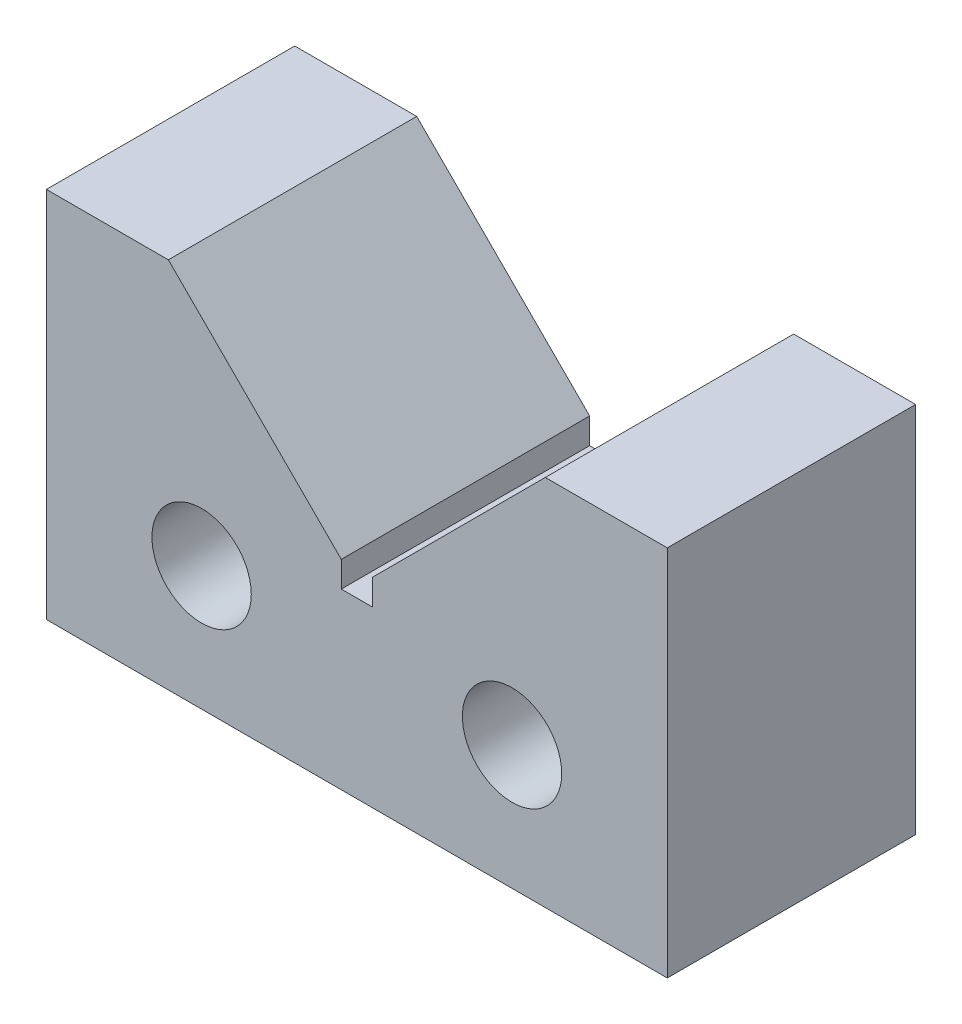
ISO-10303-21;
HEADER;
FILE_DESCRIPTION(('STEP AP214'),'2;1');
FILE_NAME('part.step','',(''),(''),'','','');
FILE_SCHEMA(('AUTOMOTIVE_DESIGN { 1 0 10303 214 1 1 1 1 }'));
ENDSEC;
DATA;
#1=APPLICATION_CONTEXT('core data for automotive mechanical design processes');
#2=APPLICATION_PROTOCOL_DEFINITION('international standard','automotive_design',2000,#1);
#3=PRODUCT_CONTEXT('',#1,'mechanical');
#4=PRODUCT('Part','Part','',(#3));
#5=PRODUCT_RELATED_PRODUCT_CATEGORY('part','',(#4));
#6=PRODUCT_DEFINITION_FORMATION('','',#4);
#7=PRODUCT_DEFINITION_CONTEXT('part definition',#1,'design');
#8=PRODUCT_DEFINITION('design','',#6,#7);
#9=PRODUCT_DEFINITION_SHAPE('','',#8);
#10=(LENGTH_UNIT() NAMED_UNIT(*) SI_UNIT(.MILLI.,.METRE.));
#11=(NAMED_UNIT(*) PLANE_ANGLE_UNIT() SI_UNIT($,.RADIAN.));
#12=(NAMED_UNIT(*) SI_UNIT($,.STERADIAN.) SOLID_ANGLE_UNIT());
#13=UNCERTAINTY_MEASURE_WITH_UNIT(LENGTH_MEASURE(1.E-05),#10,'distance_accuracy_value','');
#14=(GEOMETRIC_REPRESENTATION_CONTEXT(3) GLOBAL_UNCERTAINTY_ASSIGNED_CONTEXT((#13)) GLOBAL_UNIT_ASSIGNED_CONTEXT((#10,
#11,#12)) REPRESENTATION_CONTEXT('',''));
#15=CARTESIAN_POINT('',(0.,0.,0.));
#16=DIRECTION('',(0.,0.,1.));
#17=DIRECTION('',(1.,0.,0.));
#18=AXIS2_PLACEMENT_3D('',#15,#16,#17);
#19=CARTESIAN_POINT('',(-50.,60.,40.));
#20=DIRECTION('',(0.,-1.,0.));
#21=DIRECTION('',(0.,0.,-1.));
#22=AXIS2_PLACEMENT_3D('',#19,#20,#21);
#23=PLANE('',#22);
#24=DIRECTION('',(0.,0.,1.));
#25=VECTOR('',#24,1.);
#26=CARTESIAN_POINT('',(-30.3553390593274,60.,40.));
#27=LINE('',#26,#25);
#28=CARTESIAN_POINT('',(-30.3553390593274,60.,0.));
#29=VERTEX_POINT('',#28);
#30=CARTESIAN_POINT('',(-30.3553390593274,60.,40.));
#31=VERTEX_POINT('',#30);
#32=EDGE_CURVE('E151',#29,#31,#27,.T.);
#33=ORIENTED_EDGE('',*,*,#32,.F.);
#34=DIRECTION('',(-1.,0.,0.));
#35=VECTOR('',#34,1.);
#36=CARTESIAN_POINT('',(-50.,60.,0.));
#37=LINE('',#36,#35);
#38=CARTESIAN_POINT('',(-50.,60.,0.));
#39=VERTEX_POINT('',#38);
#40=EDGE_CURVE('E175',#29,#39,#37,.T.);
#41=ORIENTED_EDGE('',*,*,#40,.T.);
#42=DIRECTION('',(0.,0.,-1.));
#43=VECTOR('',#42,1.);
#44=CARTESIAN_POINT('',(-50.,60.,40.));
#45=LINE('',#44,#43);
#46=CARTESIAN_POINT('',(-50.,60.,40.));
#47=VERTEX_POINT('',#46);
#48=EDGE_CURVE('E168',#47,#39,#45,.T.);
#49=ORIENTED_EDGE('',*,*,#48,.F.);
#50=DIRECTION('',(-1.,0.,0.));
#51=VECTOR('',#50,1.);
#52=CARTESIAN_POINT('',(-50.,60.,40.));
#53=LINE('',#52,#51);
#54=EDGE_CURVE('E164',#31,#47,#53,.T.);
#55=ORIENTED_EDGE('',*,*,#54,.F.);
#56=EDGE_LOOP('',(#33,#41,#49,#55));
#57=FACE_BOUND('',#56,.T.);
#58=ADVANCED_FACE('F30',(#57),#23,.F.);
#59=DIRECTION('',(0.,0.,-1.));
#60=VECTOR('',#59,1.);
#61=CARTESIAN_POINT('',(30.3553390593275,60.,40.));
#62=LINE('',#61,#60);
#63=CARTESIAN_POINT('',(30.3553390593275,60.,40.));
#64=VERTEX_POINT('',#63);
#65=CARTESIAN_POINT('',(30.3553390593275,60.,0.));
#66=VERTEX_POINT('',#65);
#67=EDGE_CURVE('E142',#64,#66,#62,.T.);
#68=ORIENTED_EDGE('',*,*,#67,.F.);
#69=CARTESIAN_POINT('',(50.,60.,40.));
#70=VERTEX_POINT('',#69);
#71=EDGE_CURVE('E165',#70,#64,#53,.T.);
#72=ORIENTED_EDGE('',*,*,#71,.F.);
#73=DIRECTION('',(0.,0.,-1.));
#74=VECTOR('',#73,1.);
#75=CARTESIAN_POINT('',(50.,60.,40.));
#76=LINE('',#75,#74);
#77=CARTESIAN_POINT('',(50.,60.,0.));
#78=VERTEX_POINT('',#77);
#79=EDGE_CURVE('E180',#70,#78,#76,.T.);
#80=ORIENTED_EDGE('',*,*,#79,.T.);
#81=EDGE_CURVE('E160',#78,#66,#37,.T.);
#82=ORIENTED_EDGE('',*,*,#81,.T.);
#83=EDGE_LOOP('',(#68,#72,#80,#82));
#84=FACE_BOUND('',#83,.T.);
#85=ADVANCED_FACE('F195',(#84),#23,.F.);
#86=CARTESIAN_POINT('',(-50.,0.,40.));
#87=DIRECTION('',(0.,0.,1.));
#88=DIRECTION('',(1.,0.,0.));
#89=AXIS2_PLACEMENT_3D('',#86,#87,#88);
#90=PLANE('',#89);
#91=CARTESIAN_POINT('',(25.,20.,40.));
#92=DIRECTION('',(0.,0.,1.));
#93=DIRECTION('',(1.,0.,0.));
#94=AXIS2_PLACEMENT_3D('',#91,#92,#93);
#95=CIRCLE('',#94,8.);
#96=CARTESIAN_POINT('',(33.,20.,40.));
#97=VERTEX_POINT('',#96);
#98=EDGE_CURVE('E337',#97,#97,#95,.T.);
#99=ORIENTED_EDGE('',*,*,#98,.F.);
#100=EDGE_LOOP('',(#99));
#101=FACE_BOUND('',#100,.T.);
#102=CARTESIAN_POINT('',(-25.,20.,40.));
#103=DIRECTION('',(0.,0.,1.));
#104=DIRECTION('',(1.,0.,0.));
#105=AXIS2_PLACEMENT_3D('',#102,#103,#104);
#106=CIRCLE('',#105,8.);
#107=CARTESIAN_POINT('',(-17.,20.,40.));
#108=VERTEX_POINT('',#107);
#109=EDGE_CURVE('E133',#108,#108,#106,.T.);
#110=ORIENTED_EDGE('',*,*,#109,.F.);
#111=EDGE_LOOP('',(#110));
#112=FACE_BOUND('',#111,.T.);
#113=DIRECTION('',(0.,-1.,0.));
#114=VECTOR('',#113,1.);
#115=CARTESIAN_POINT('',(-2.5,28.,40.));
#116=LINE('',#115,#114);
#117=CARTESIAN_POINT('',(-2.5,32.1446609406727,40.));
#118=VERTEX_POINT('',#117);
#119=CARTESIAN_POINT('',(-2.5,28.,40.));
#120=VERTEX_POINT('',#119);
#121=EDGE_CURVE('E112',#118,#120,#116,.T.);
#122=ORIENTED_EDGE('',*,*,#121,.F.);
#123=DIRECTION('',(-0.707106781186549,0.707106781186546,0.));
#124=VECTOR('',#123,1.);
#125=CARTESIAN_POINT('',(-10.1776695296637,39.8223304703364,40.));
#126=LINE('',#125,#124);
#127=EDGE_CURVE('E53',#118,#31,#126,.T.);
#128=ORIENTED_EDGE('',*,*,#127,.T.);
#129=ORIENTED_EDGE('',*,*,#54,.T.);
#130=DIRECTION('',(0.,-1.,0.));
#131=VECTOR('',#130,1.);
#132=CARTESIAN_POINT('',(-50.,60.,40.));
#133=LINE('',#132,#131);
#134=CARTESIAN_POINT('',(-50.,0.,40.));
#135=VERTEX_POINT('',#134);
#136=EDGE_CURVE('E156',#47,#135,#133,.T.);
#137=ORIENTED_EDGE('',*,*,#136,.T.);
#138=DIRECTION('',(1.,0.,0.));
#139=VECTOR('',#138,1.);
#140=CARTESIAN_POINT('',(-50.,0.,40.));
#141=LINE('',#140,#139);
#142=CARTESIAN_POINT('',(50.,0.,40.));
#143=VERTEX_POINT('',#142);
#144=EDGE_CURVE('E159',#135,#143,#141,.T.);
#145=ORIENTED_EDGE('',*,*,#144,.T.);
#146=DIRECTION('',(0.,1.,0.));
#147=VECTOR('',#146,1.);
#148=CARTESIAN_POINT('',(50.,60.,40.));
#149=LINE('',#148,#147);
#150=EDGE_CURVE('E162',#143,#70,#149,.T.);
#151=ORIENTED_EDGE('',*,*,#150,.T.);
#152=ORIENTED_EDGE('',*,*,#71,.T.);
#153=DIRECTION('',(-0.70710678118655,-0.707106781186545,0.));
#154=VECTOR('',#153,1.);
#155=CARTESIAN_POINT('',(-39.8223304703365,-10.1776695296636,40.));
#156=LINE('',#155,#154);
#157=CARTESIAN_POINT('',(2.5,32.1446609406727,40.));
#158=VERTEX_POINT('',#157);
#159=EDGE_CURVE('E148',#64,#158,#156,.T.);
#160=ORIENTED_EDGE('',*,*,#159,.T.);
#161=DIRECTION('',(0.,1.,0.));
#162=VECTOR('',#161,1.);
#163=CARTESIAN_POINT('',(2.5,32.1446609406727,40.));
#164=LINE('',#163,#162);
#165=CARTESIAN_POINT('',(2.5,28.,40.));
#166=VERTEX_POINT('',#165);
#167=EDGE_CURVE('E45',#166,#158,#164,.T.);
#168=ORIENTED_EDGE('',*,*,#167,.F.);
#169=DIRECTION('',(1.,0.,0.));
#170=VECTOR('',#169,1.);
#171=CARTESIAN_POINT('',(2.5,28.,40.));
#172=LINE('',#171,#170);
#173=EDGE_CURVE('E130',#120,#166,#172,.T.);
#174=ORIENTED_EDGE('',*,*,#173,.F.);
#175=EDGE_LOOP('',(#122,#128,#129,#137,#145,#151,#152,#160,#168,#174));
#176=FACE_BOUND('',#175,.T.);
#177=ADVANCED_FACE('F213',(#101,#112,#176),#90,.T.);
#178=CARTESIAN_POINT('',(-50.,0.,0.));
#179=DIRECTION('',(0.,0.,1.));
#180=DIRECTION('',(1.,0.,0.));
#181=AXIS2_PLACEMENT_3D('',#178,#179,#180);
#182=PLANE('',#181);
#183=CARTESIAN_POINT('',(25.,20.,0.));
#184=DIRECTION('',(0.,0.,1.));
#185=DIRECTION('',(1.,0.,0.));
#186=AXIS2_PLACEMENT_3D('',#183,#184,#185);
#187=CIRCLE('',#186,8.);
#188=CARTESIAN_POINT('',(33.,20.,0.));
#189=VERTEX_POINT('',#188);
#190=EDGE_CURVE('E335',#189,#189,#187,.T.);
#191=ORIENTED_EDGE('',*,*,#190,.T.);
#192=EDGE_LOOP('',(#191));
#193=FACE_BOUND('',#192,.T.);
#194=CARTESIAN_POINT('',(-25.,20.,0.));
#195=DIRECTION('',(0.,0.,1.));
#196=DIRECTION('',(1.,0.,0.));
#197=AXIS2_PLACEMENT_3D('',#194,#195,#196);
#198=CIRCLE('',#197,8.);
#199=CARTESIAN_POINT('',(-17.,20.,0.));
#200=VERTEX_POINT('',#199);
#201=EDGE_CURVE('E138',#200,#200,#198,.T.);
#202=ORIENTED_EDGE('',*,*,#201,.T.);
#203=EDGE_LOOP('',(#202));
#204=FACE_BOUND('',#203,.T.);
#205=DIRECTION('',(-0.707106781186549,0.707106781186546,0.));
#206=VECTOR('',#205,1.);
#207=CARTESIAN_POINT('',(-10.1776695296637,39.8223304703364,0.));
#208=LINE('',#207,#206);
#209=CARTESIAN_POINT('',(-2.5,32.1446609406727,0.));
#210=VERTEX_POINT('',#209);
#211=EDGE_CURVE('E11',#210,#29,#208,.T.);
#212=ORIENTED_EDGE('',*,*,#211,.F.);
#213=DIRECTION('',(0.,-1.,0.));
#214=VECTOR('',#213,1.);
#215=CARTESIAN_POINT('',(-2.5,28.,0.));
#216=LINE('',#215,#214);
#217=CARTESIAN_POINT('',(-2.5,28.,0.));
#218=VERTEX_POINT('',#217);
#219=EDGE_CURVE('E110',#210,#218,#216,.T.);
#220=ORIENTED_EDGE('',*,*,#219,.T.);
#221=DIRECTION('',(1.,0.,0.));
#222=VECTOR('',#221,1.);
#223=CARTESIAN_POINT('',(2.5,28.,0.));
#224=LINE('',#223,#222);
#225=CARTESIAN_POINT('',(2.5,28.,0.));
#226=VERTEX_POINT('',#225);
#227=EDGE_CURVE('E120',#218,#226,#224,.T.);
#228=ORIENTED_EDGE('',*,*,#227,.T.);
#229=DIRECTION('',(0.,1.,0.));
#230=VECTOR('',#229,1.);
#231=CARTESIAN_POINT('',(2.5,32.1446609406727,0.));
#232=LINE('',#231,#230);
#233=CARTESIAN_POINT('',(2.5,32.1446609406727,0.));
#234=VERTEX_POINT('',#233);
#235=EDGE_CURVE('E117',#226,#234,#232,.T.);
#236=ORIENTED_EDGE('',*,*,#235,.T.);
#237=DIRECTION('',(-0.70710678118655,-0.707106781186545,0.));
#238=VECTOR('',#237,1.);
#239=CARTESIAN_POINT('',(-39.8223304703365,-10.1776695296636,0.));
#240=LINE('',#239,#238);
#241=EDGE_CURVE('E38',#66,#234,#240,.T.);
#242=ORIENTED_EDGE('',*,*,#241,.F.);
#243=ORIENTED_EDGE('',*,*,#81,.F.);
#244=DIRECTION('',(0.,1.,0.));
#245=VECTOR('',#244,1.);
#246=CARTESIAN_POINT('',(50.,60.,0.));
#247=LINE('',#246,#245);
#248=CARTESIAN_POINT('',(50.,0.,0.));
#249=VERTEX_POINT('',#248);
#250=EDGE_CURVE('E173',#249,#78,#247,.T.);
#251=ORIENTED_EDGE('',*,*,#250,.F.);
#252=DIRECTION('',(1.,0.,0.));
#253=VECTOR('',#252,1.);
#254=CARTESIAN_POINT('',(-50.,0.,0.));
#255=LINE('',#254,#253);
#256=CARTESIAN_POINT('',(-50.,0.,0.));
#257=VERTEX_POINT('',#256);
#258=EDGE_CURVE('E171',#257,#249,#255,.T.);
#259=ORIENTED_EDGE('',*,*,#258,.F.);
#260=DIRECTION('',(0.,-1.,0.));
#261=VECTOR('',#260,1.);
#262=CARTESIAN_POINT('',(-50.,60.,0.));
#263=LINE('',#262,#261);
#264=EDGE_CURVE('E155',#39,#257,#263,.T.);
#265=ORIENTED_EDGE('',*,*,#264,.F.);
#266=ORIENTED_EDGE('',*,*,#40,.F.);
#267=EDGE_LOOP('',(#212,#220,#228,#236,#242,#243,#251,#259,#265,#266));
#268=FACE_BOUND('',#267,.T.);
#269=ADVANCED_FACE('F127',(#193,#204,#268),#182,.F.);
#270=CARTESIAN_POINT('',(-50.,60.,40.));
#271=DIRECTION('',(1.,0.,0.));
#272=DIRECTION('',(0.,1.,0.));
#273=AXIS2_PLACEMENT_3D('',#270,#271,#272);
#274=PLANE('',#273);
#275=ORIENTED_EDGE('',*,*,#264,.T.);
#276=DIRECTION('',(0.,0.,-1.));
#277=VECTOR('',#276,1.);
#278=CARTESIAN_POINT('',(-50.,0.,40.));
#279=LINE('',#278,#277);
#280=EDGE_CURVE('E186',#135,#257,#279,.T.);
#281=ORIENTED_EDGE('',*,*,#280,.F.);
#282=ORIENTED_EDGE('',*,*,#136,.F.);
#283=ORIENTED_EDGE('',*,*,#48,.T.);
#284=EDGE_LOOP('',(#275,#281,#282,#283));
#285=FACE_BOUND('',#284,.T.);
#286=ADVANCED_FACE('F32',(#285),#274,.F.);
#287=CARTESIAN_POINT('',(-50.,0.,40.));
#288=DIRECTION('',(0.,1.,0.));
#289=DIRECTION('',(0.,0.,1.));
#290=AXIS2_PLACEMENT_3D('',#287,#288,#289);
#291=PLANE('',#290);
#292=ORIENTED_EDGE('',*,*,#258,.T.);
#293=DIRECTION('',(0.,0.,-1.));
#294=VECTOR('',#293,1.);
#295=CARTESIAN_POINT('',(50.,0.,40.));
#296=LINE('',#295,#294);
#297=EDGE_CURVE('E183',#143,#249,#296,.T.);
#298=ORIENTED_EDGE('',*,*,#297,.F.);
#299=ORIENTED_EDGE('',*,*,#144,.F.);
#300=ORIENTED_EDGE('',*,*,#280,.T.);
#301=EDGE_LOOP('',(#292,#298,#299,#300));
#302=FACE_BOUND('',#301,.T.);
#303=ADVANCED_FACE('F205',(#302),#291,.F.);
#304=CARTESIAN_POINT('',(50.,60.,40.));
#305=DIRECTION('',(-1.,0.,0.));
#306=DIRECTION('',(0.,-1.,0.));
#307=AXIS2_PLACEMENT_3D('',#304,#305,#306);
#308=PLANE('',#307);
#309=ORIENTED_EDGE('',*,*,#250,.T.);
#310=ORIENTED_EDGE('',*,*,#79,.F.);
#311=ORIENTED_EDGE('',*,*,#150,.F.);
#312=ORIENTED_EDGE('',*,*,#297,.T.);
#313=EDGE_LOOP('',(#309,#310,#311,#312));
#314=FACE_BOUND('',#313,.T.);
#315=ADVANCED_FACE('F200',(#314),#308,.F.);
#316=CARTESIAN_POINT('',(0.,29.6446609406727,154.110350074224));
#317=DIRECTION('',(0.707106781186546,0.707106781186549,0.));
#318=DIRECTION('',(-0.707106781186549,0.707106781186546,0.));
#319=AXIS2_PLACEMENT_3D('',#316,#317,#318);
#320=PLANE('',#319);
#321=DIRECTION('',(0.,0.,1.));
#322=VECTOR('',#321,1.);
#323=CARTESIAN_POINT('',(-2.5,32.1446609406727,0.));
#324=LINE('',#323,#322);
#325=EDGE_CURVE('E140',#210,#118,#324,.T.);
#326=ORIENTED_EDGE('',*,*,#325,.F.);
#327=ORIENTED_EDGE('',*,*,#211,.T.);
#328=ORIENTED_EDGE('',*,*,#32,.T.);
#329=ORIENTED_EDGE('',*,*,#127,.F.);
#330=EDGE_LOOP('',(#326,#327,#328,#329));
#331=FACE_BOUND('',#330,.T.);
#332=ADVANCED_FACE('F212',(#331),#320,.T.);
#333=CARTESIAN_POINT('',(0.,29.6446609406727,154.110350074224));
#334=DIRECTION('',(-0.707106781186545,0.70710678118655,0.));
#335=DIRECTION('',(-0.70710678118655,-0.707106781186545,0.));
#336=AXIS2_PLACEMENT_3D('',#333,#334,#335);
#337=PLANE('',#336);
#338=DIRECTION('',(0.,0.,1.));
#339=VECTOR('',#338,1.);
#340=CARTESIAN_POINT('',(2.5,32.1446609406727,0.));
#341=LINE('',#340,#339);
#342=EDGE_CURVE('E143',#234,#158,#341,.T.);
#343=ORIENTED_EDGE('',*,*,#342,.T.);
#344=ORIENTED_EDGE('',*,*,#159,.F.);
#345=ORIENTED_EDGE('',*,*,#67,.T.);
#346=ORIENTED_EDGE('',*,*,#241,.T.);
#347=EDGE_LOOP('',(#343,#344,#345,#346));
#348=FACE_BOUND('',#347,.T.);
#349=ADVANCED_FACE('F190',(#348),#337,.T.);
#350=CARTESIAN_POINT('',(-2.5,28.,0.));
#351=DIRECTION('',(-1.,0.,0.));
#352=DIRECTION('',(0.,-1.,0.));
#353=AXIS2_PLACEMENT_3D('',#350,#351,#352);
#354=PLANE('',#353);
#355=ORIENTED_EDGE('',*,*,#121,.T.);
#356=DIRECTION('',(0.,0.,1.));
#357=VECTOR('',#356,1.);
#358=CARTESIAN_POINT('',(-2.5,28.,0.));
#359=LINE('',#358,#357);
#360=EDGE_CURVE('E106',#218,#120,#359,.T.);
#361=ORIENTED_EDGE('',*,*,#360,.F.);
#362=ORIENTED_EDGE('',*,*,#219,.F.);
#363=ORIENTED_EDGE('',*,*,#325,.T.);
#364=EDGE_LOOP('',(#355,#361,#362,#363));
#365=FACE_BOUND('',#364,.T.);
#366=ADVANCED_FACE('F108',(#365),#354,.F.);
#367=CARTESIAN_POINT('',(2.5,32.1446609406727,0.));
#368=DIRECTION('',(1.,0.,0.));
#369=DIRECTION('',(0.,0.,-1.));
#370=AXIS2_PLACEMENT_3D('',#367,#368,#369);
#371=PLANE('',#370);
#372=ORIENTED_EDGE('',*,*,#167,.T.);
#373=ORIENTED_EDGE('',*,*,#342,.F.);
#374=ORIENTED_EDGE('',*,*,#235,.F.);
#375=DIRECTION('',(0.,0.,1.));
#376=VECTOR('',#375,1.);
#377=CARTESIAN_POINT('',(2.5,28.,0.));
#378=LINE('',#377,#376);
#379=EDGE_CURVE('E116',#226,#166,#378,.T.);
#380=ORIENTED_EDGE('',*,*,#379,.T.);
#381=EDGE_LOOP('',(#372,#373,#374,#380));
#382=FACE_BOUND('',#381,.T.);
#383=ADVANCED_FACE('F275',(#382),#371,.F.);
#384=CARTESIAN_POINT('',(2.5,28.,0.));
#385=DIRECTION('',(0.,-1.,0.));
#386=DIRECTION('',(0.,0.,-1.));
#387=AXIS2_PLACEMENT_3D('',#384,#385,#386);
#388=PLANE('',#387);
#389=ORIENTED_EDGE('',*,*,#173,.T.);
#390=ORIENTED_EDGE('',*,*,#379,.F.);
#391=ORIENTED_EDGE('',*,*,#227,.F.);
#392=ORIENTED_EDGE('',*,*,#360,.T.);
#393=EDGE_LOOP('',(#389,#390,#391,#392));
#394=FACE_BOUND('',#393,.T.);
#395=ADVANCED_FACE('F121',(#394),#388,.F.);
#396=CARTESIAN_POINT('',(-25.,20.,0.));
#397=DIRECTION('',(0.,0.,1.));
#398=DIRECTION('',(1.,0.,0.));
#399=AXIS2_PLACEMENT_3D('',#396,#397,#398);
#400=CYLINDRICAL_SURFACE('',#399,8.);
#401=ORIENTED_EDGE('',*,*,#201,.F.);
#402=EDGE_LOOP('',(#401));
#403=FACE_BOUND('',#402,.T.);
#404=ORIENTED_EDGE('',*,*,#109,.T.);
#405=EDGE_LOOP('',(#404));
#406=FACE_BOUND('',#405,.T.);
#407=ADVANCED_FACE('F251',(#403,#406),#400,.F.);
#408=CARTESIAN_POINT('',(25.,20.,0.));
#409=DIRECTION('',(0.,0.,1.));
#410=DIRECTION('',(1.,0.,0.));
#411=AXIS2_PLACEMENT_3D('',#408,#409,#410);
#412=CYLINDRICAL_SURFACE('',#411,8.);
#413=ORIENTED_EDGE('',*,*,#190,.F.);
#414=EDGE_LOOP('',(#413));
#415=FACE_BOUND('',#414,.T.);
#416=ORIENTED_EDGE('',*,*,#98,.T.);
#417=EDGE_LOOP('',(#416));
#418=FACE_BOUND('',#417,.T.);
#419=ADVANCED_FACE('F256',(#415,#418),#412,.F.);
#420=CLOSED_SHELL('',(#58,#85,#177,#269,#286,#303,#315,#332,#349,#366,#383,#395,#407,#419));
#421=MANIFOLD_SOLID_BREP('B2',#420);
#422=ADVANCED_BREP_SHAPE_REPRESENTATION('',(#18,#421),#14);
#423=SHAPE_DEFINITION_REPRESENTATION(#9,#422);
ENDSEC;
END-ISO-10303-21;
